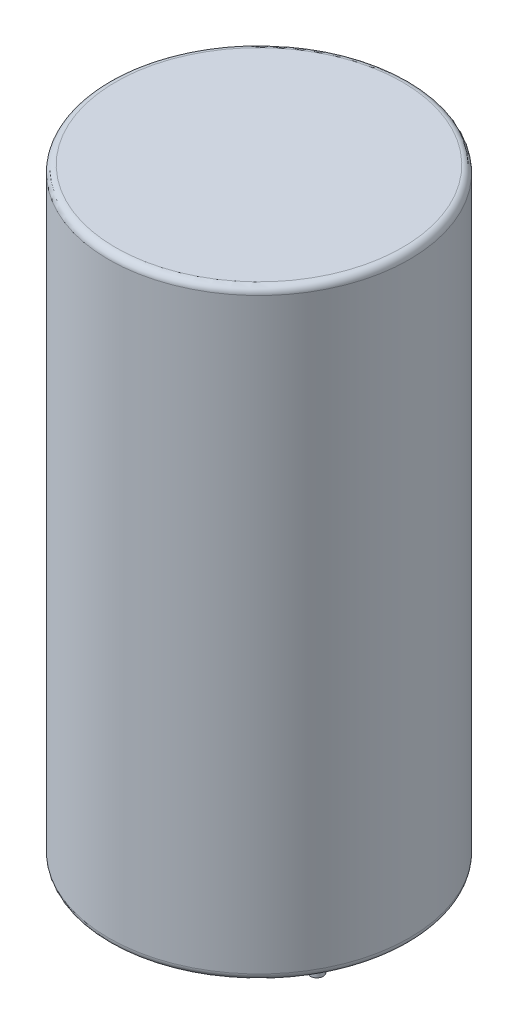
ISO-10303-21;
HEADER;
FILE_DESCRIPTION(('STEP AP214'),'2;1');
FILE_NAME('part.step','',(''),(''),'','','');
FILE_SCHEMA(('AUTOMOTIVE_DESIGN { 1 0 10303 214 1 1 1 1 }'));
ENDSEC;
DATA;
#1=APPLICATION_CONTEXT('core data for automotive mechanical design processes');
#2=APPLICATION_PROTOCOL_DEFINITION('international standard','automotive_design',2000,#1);
#3=PRODUCT_CONTEXT('',#1,'mechanical');
#4=PRODUCT('Part','Part','',(#3));
#5=PRODUCT_RELATED_PRODUCT_CATEGORY('part','',(#4));
#6=PRODUCT_DEFINITION_FORMATION('','',#4);
#7=PRODUCT_DEFINITION_CONTEXT('part definition',#1,'design');
#8=PRODUCT_DEFINITION('design','',#6,#7);
#9=PRODUCT_DEFINITION_SHAPE('','',#8);
#10=(LENGTH_UNIT() NAMED_UNIT(*) SI_UNIT(.MILLI.,.METRE.));
#11=(NAMED_UNIT(*) PLANE_ANGLE_UNIT() SI_UNIT($,.RADIAN.));
#12=(NAMED_UNIT(*) SI_UNIT($,.STERADIAN.) SOLID_ANGLE_UNIT());
#13=UNCERTAINTY_MEASURE_WITH_UNIT(LENGTH_MEASURE(1.E-05),#10,'distance_accuracy_value','');
#14=(GEOMETRIC_REPRESENTATION_CONTEXT(3) GLOBAL_UNCERTAINTY_ASSIGNED_CONTEXT((#13)) GLOBAL_UNIT_ASSIGNED_CONTEXT((#10,
#11,#12)) REPRESENTATION_CONTEXT('',''));
#15=CARTESIAN_POINT('',(0.,0.,0.));
#16=DIRECTION('',(0.,0.,1.));
#17=DIRECTION('',(1.,0.,0.));
#18=AXIS2_PLACEMENT_3D('',#15,#16,#17);
#19=CARTESIAN_POINT('',(0.,0.,0.));
#20=DIRECTION('',(0.,1.,0.));
#21=DIRECTION('',(0.,0.,1.));
#22=AXIS2_PLACEMENT_3D('',#19,#20,#21);
#23=PLANE('',#22);
#24=CARTESIAN_POINT('',(-2.5,0.,0.));
#25=DIRECTION('',(0.,1.,0.));
#26=DIRECTION('',(0.,0.,1.));
#27=AXIS2_PLACEMENT_3D('',#24,#25,#26);
#28=CIRCLE('',#27,0.275);
#29=CARTESIAN_POINT('',(-2.5,0.,0.275));
#30=VERTEX_POINT('',#29);
#31=EDGE_CURVE('E49',#30,#30,#28,.F.);
#32=ORIENTED_EDGE('',*,*,#31,.F.);
#33=EDGE_LOOP('',(#32));
#34=FACE_BOUND('',#33,.T.);
#35=CARTESIAN_POINT('',(0.,0.,0.));
#36=DIRECTION('',(0.,1.,0.));
#37=DIRECTION('',(0.,0.,1.));
#38=AXIS2_PLACEMENT_3D('',#35,#36,#37);
#39=CIRCLE('',#38,6.2);
#40=CARTESIAN_POINT('',(0.,0.,6.2));
#41=VERTEX_POINT('',#40);
#42=EDGE_CURVE('E57',#41,#41,#39,.F.);
#43=ORIENTED_EDGE('',*,*,#42,.T.);
#44=EDGE_LOOP('',(#43));
#45=FACE_BOUND('',#44,.T.);
#46=CARTESIAN_POINT('',(2.5,0.,0.));
#47=DIRECTION('',(0.,1.,0.));
#48=DIRECTION('',(0.,0.,1.));
#49=AXIS2_PLACEMENT_3D('',#46,#47,#48);
#50=CIRCLE('',#49,0.275);
#51=CARTESIAN_POINT('',(2.5,0.,0.275));
#52=VERTEX_POINT('',#51);
#53=EDGE_CURVE('E12',#52,#52,#50,.F.);
#54=ORIENTED_EDGE('',*,*,#53,.F.);
#55=EDGE_LOOP('',(#54));
#56=FACE_BOUND('',#55,.T.);
#57=ADVANCED_FACE('F42',(#34,#45,#56),#23,.F.);
#58=CARTESIAN_POINT('',(0.,26.,0.));
#59=DIRECTION('',(0.,-1.,0.));
#60=DIRECTION('',(0.,0.,-1.));
#61=AXIS2_PLACEMENT_3D('',#58,#59,#60);
#62=CYLINDRICAL_SURFACE('',#61,6.5);
#63=CARTESIAN_POINT('',(0.,0.300000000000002,0.));
#64=DIRECTION('',(0.,1.,0.));
#65=DIRECTION('',(0.,0.,1.));
#66=AXIS2_PLACEMENT_3D('',#63,#64,#65);
#67=CIRCLE('',#66,6.5);
#68=CARTESIAN_POINT('',(0.,0.300000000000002,-6.5));
#69=VERTEX_POINT('',#68);
#70=EDGE_CURVE('E62',#69,#69,#67,.T.);
#71=CARTESIAN_POINT('',(0.,25.7,0.));
#72=DIRECTION('',(0.,1.,0.));
#73=DIRECTION('',(0.,0.,1.));
#74=AXIS2_PLACEMENT_3D('',#71,#72,#73);
#75=CIRCLE('',#74,6.5);
#76=CARTESIAN_POINT('',(0.,25.7,-6.5));
#77=VERTEX_POINT('',#76);
#78=EDGE_CURVE('E65',#77,#77,#75,.F.);
#79=CARTESIAN_POINT('',(0.,0.300000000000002,-6.5));
#80=CARTESIAN_POINT('',(0.,0.564583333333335,-6.5));
#81=CARTESIAN_POINT('',(0.,0.829166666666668,-6.5));
#82=CARTESIAN_POINT('',(0.,1.35833333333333,-6.5));
#83=CARTESIAN_POINT('',(0.,1.62291666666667,-6.5));
#84=CARTESIAN_POINT('',(0.,2.15208333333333,-6.5));
#85=CARTESIAN_POINT('',(0.,2.41666666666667,-6.5));
#86=CARTESIAN_POINT('',(0.,2.94583333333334,-6.5));
#87=CARTESIAN_POINT('',(0.,3.21041666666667,-6.5));
#88=CARTESIAN_POINT('',(0.,3.73958333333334,-6.5));
#89=CARTESIAN_POINT('',(0.,4.00416666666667,-6.5));
#90=CARTESIAN_POINT('',(0.,4.53333333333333,-6.5));
#91=CARTESIAN_POINT('',(0.,4.79791666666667,-6.5));
#92=CARTESIAN_POINT('',(0.,5.32708333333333,-6.5));
#93=CARTESIAN_POINT('',(0.,5.59166666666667,-6.5));
#94=CARTESIAN_POINT('',(0.,6.12083333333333,-6.5));
#95=CARTESIAN_POINT('',(0.,6.38541666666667,-6.5));
#96=CARTESIAN_POINT('',(0.,6.91458333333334,-6.5));
#97=CARTESIAN_POINT('',(0.,7.17916666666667,-6.5));
#98=CARTESIAN_POINT('',(0.,7.70833333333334,-6.5));
#99=CARTESIAN_POINT('',(0.,7.97291666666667,-6.5));
#100=CARTESIAN_POINT('',(0.,8.50208333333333,-6.5));
#101=CARTESIAN_POINT('',(0.,8.76666666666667,-6.5));
#102=CARTESIAN_POINT('',(0.,9.29583333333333,-6.5));
#103=CARTESIAN_POINT('',(0.,9.56041666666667,-6.5));
#104=CARTESIAN_POINT('',(0.,10.0895833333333,-6.5));
#105=CARTESIAN_POINT('',(0.,10.3541666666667,-6.5));
#106=CARTESIAN_POINT('',(0.,10.8833333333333,-6.5));
#107=CARTESIAN_POINT('',(0.,11.1479166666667,-6.5));
#108=CARTESIAN_POINT('',(0.,11.6770833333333,-6.5));
#109=CARTESIAN_POINT('',(0.,11.9416666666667,-6.5));
#110=CARTESIAN_POINT('',(0.,12.4708333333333,-6.5));
#111=CARTESIAN_POINT('',(0.,12.7354166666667,-6.5));
#112=CARTESIAN_POINT('',(0.,13.2645833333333,-6.5));
#113=CARTESIAN_POINT('',(0.,13.5291666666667,-6.5));
#114=CARTESIAN_POINT('',(0.,14.0583333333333,-6.5));
#115=CARTESIAN_POINT('',(0.,14.3229166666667,-6.5));
#116=CARTESIAN_POINT('',(0.,14.8520833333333,-6.5));
#117=CARTESIAN_POINT('',(0.,15.1166666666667,-6.5));
#118=CARTESIAN_POINT('',(0.,15.6458333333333,-6.5));
#119=CARTESIAN_POINT('',(0.,15.9104166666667,-6.5));
#120=CARTESIAN_POINT('',(0.,16.4395833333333,-6.5));
#121=CARTESIAN_POINT('',(0.,16.7041666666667,-6.5));
#122=CARTESIAN_POINT('',(0.,17.2333333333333,-6.5));
#123=CARTESIAN_POINT('',(0.,17.4979166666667,-6.5));
#124=CARTESIAN_POINT('',(0.,18.0270833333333,-6.5));
#125=CARTESIAN_POINT('',(0.,18.2916666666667,-6.5));
#126=CARTESIAN_POINT('',(0.,18.8208333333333,-6.5));
#127=CARTESIAN_POINT('',(0.,19.0854166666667,-6.5));
#128=CARTESIAN_POINT('',(0.,19.6145833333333,-6.5));
#129=CARTESIAN_POINT('',(0.,19.8791666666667,-6.5));
#130=CARTESIAN_POINT('',(0.,20.4083333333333,-6.5));
#131=CARTESIAN_POINT('',(0.,20.6729166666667,-6.5));
#132=CARTESIAN_POINT('',(0.,21.2020833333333,-6.5));
#133=CARTESIAN_POINT('',(0.,21.4666666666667,-6.5));
#134=CARTESIAN_POINT('',(0.,21.9958333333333,-6.5));
#135=CARTESIAN_POINT('',(0.,22.2604166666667,-6.5));
#136=CARTESIAN_POINT('',(0.,22.7895833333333,-6.5));
#137=CARTESIAN_POINT('',(0.,23.0541666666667,-6.5));
#138=CARTESIAN_POINT('',(0.,23.5833333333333,-6.5));
#139=CARTESIAN_POINT('',(0.,23.8479166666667,-6.5));
#140=CARTESIAN_POINT('',(0.,24.3770833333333,-6.5));
#141=CARTESIAN_POINT('',(0.,24.6416666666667,-6.5));
#142=CARTESIAN_POINT('',(0.,25.1708333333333,-6.5));
#143=CARTESIAN_POINT('',(0.,25.4354166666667,-6.5));
#144=CARTESIAN_POINT('',(0.,25.7,-6.5));
#145=B_SPLINE_CURVE_WITH_KNOTS('',3,(#79,#80,#81,#82,#83,#84,#85,#86,#87,#88,#89,#90,#91,#92,
#93,#94,#95,#96,#97,#98,#99,#100,#101,#102,#103,#104,#105,#106,#107,#108,#109,#110,#111,#112,
#113,#114,#115,#116,#117,#118,#119,#120,#121,#122,#123,#124,#125,#126,#127,#128,#129,#130,#131,
#132,#133,#134,#135,#136,#137,#138,#139,#140,#141,#142,#143,#144),.UNSPECIFIED.,.F.,.F.,(4,2,2,
2,2,2,2,2,2,2,2,2,2,2,2,2,2,2,2,2,2,2,2,2,2,2,2,2,2,2,2,2,4),(0.,0.793749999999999,1.5875,
2.38125,3.175,3.96875,4.7625,5.55625,6.35,7.14375,7.9375,8.73125,9.525,10.31875,11.1125,
11.90625,12.7,13.49375,14.2875,15.08125,15.875,16.66875,17.4625,18.25625,19.05,19.84375,20.6375,
21.43125,22.225,23.01875,23.8125,24.60625,25.4),.UNSPECIFIED.);
#146=EDGE_CURVE('BSEAM90',#69,#77,#145,.T.);
#147=ORIENTED_EDGE('',*,*,#70,.T.);
#148=ORIENTED_EDGE('',*,*,#78,.T.);
#149=ORIENTED_EDGE('',*,*,#146,.T.);
#150=ORIENTED_EDGE('',*,*,#146,.F.);
#151=EDGE_LOOP('',(#147,#149,#148,#150));
#152=FACE_BOUND('',#151,.T.);
#153=ADVANCED_FACE('F90',(#152),#62,.T.);
#154=CARTESIAN_POINT('',(0.,26.,0.));
#155=DIRECTION('',(0.,1.,0.));
#156=DIRECTION('',(0.,0.,1.));
#157=AXIS2_PLACEMENT_3D('',#154,#155,#156);
#158=PLANE('',#157);
#159=CARTESIAN_POINT('',(0.,26.,0.));
#160=DIRECTION('',(0.,1.,0.));
#161=DIRECTION('',(0.,0.,1.));
#162=AXIS2_PLACEMENT_3D('',#159,#160,#161);
#163=CIRCLE('',#162,6.2);
#164=CARTESIAN_POINT('',(0.,26.,6.2));
#165=VERTEX_POINT('',#164);
#166=EDGE_CURVE('E53',#165,#165,#163,.T.);
#167=ORIENTED_EDGE('',*,*,#166,.T.);
#168=EDGE_LOOP('',(#167));
#169=FACE_BOUND('',#168,.T.);
#170=ADVANCED_FACE('F96',(#169),#158,.T.);
#171=CARTESIAN_POINT('',(0.,0.300000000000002,0.));
#172=DIRECTION('',(0.,1.,0.));
#173=DIRECTION('',(0.,0.,1.));
#174=AXIS2_PLACEMENT_3D('',#171,#172,#173);
#175=TOROIDAL_SURFACE('',#174,6.2,0.3);
#176=ORIENTED_EDGE('',*,*,#42,.F.);
#177=EDGE_LOOP('',(#176));
#178=FACE_BOUND('',#177,.T.);
#179=ORIENTED_EDGE('',*,*,#70,.F.);
#180=EDGE_LOOP('',(#179));
#181=FACE_BOUND('',#180,.T.);
#182=ADVANCED_FACE('F102',(#178,#181),#175,.T.);
#183=CARTESIAN_POINT('',(0.,25.7,0.));
#184=DIRECTION('',(0.,1.,0.));
#185=DIRECTION('',(0.,0.,1.));
#186=AXIS2_PLACEMENT_3D('',#183,#184,#185);
#187=TOROIDAL_SURFACE('',#186,6.2,0.3);
#188=ORIENTED_EDGE('',*,*,#78,.F.);
#189=EDGE_LOOP('',(#188));
#190=FACE_BOUND('',#189,.T.);
#191=ORIENTED_EDGE('',*,*,#166,.F.);
#192=EDGE_LOOP('',(#191));
#193=FACE_BOUND('',#192,.T.);
#194=ADVANCED_FACE('F44',(#190,#193),#187,.T.);
#195=CARTESIAN_POINT('',(-2.5,-3.,0.));
#196=DIRECTION('',(0.,1.,0.));
#197=DIRECTION('',(0.,0.,1.));
#198=AXIS2_PLACEMENT_3D('',#195,#196,#197);
#199=CYLINDRICAL_SURFACE('',#198,0.275);
#200=CARTESIAN_POINT('',(-2.5,-3.,0.));
#201=DIRECTION('',(0.,-1.,0.));
#202=DIRECTION('',(0.,0.,-1.));
#203=AXIS2_PLACEMENT_3D('',#200,#201,#202);
#204=CIRCLE('',#203,0.275);
#205=CARTESIAN_POINT('',(-2.5,-3.,-0.275));
#206=VERTEX_POINT('',#205);
#207=EDGE_CURVE('E68',#206,#206,#204,.T.);
#208=ORIENTED_EDGE('',*,*,#207,.F.);
#209=EDGE_LOOP('',(#208));
#210=FACE_BOUND('',#209,.T.);
#211=ORIENTED_EDGE('',*,*,#31,.T.);
#212=EDGE_LOOP('',(#211));
#213=FACE_BOUND('',#212,.T.);
#214=ADVANCED_FACE('F86',(#210,#213),#199,.T.);
#215=CARTESIAN_POINT('',(-2.5,-3.,0.));
#216=DIRECTION('',(0.,-1.,0.));
#217=DIRECTION('',(0.,0.,-1.));
#218=AXIS2_PLACEMENT_3D('',#215,#216,#217);
#219=PLANE('',#218);
#220=ORIENTED_EDGE('',*,*,#207,.T.);
#221=EDGE_LOOP('',(#220));
#222=FACE_BOUND('',#221,.T.);
#223=ADVANCED_FACE('F79',(#222),#219,.T.);
#224=CARTESIAN_POINT('',(2.5,-3.,0.));
#225=DIRECTION('',(0.,1.,0.));
#226=DIRECTION('',(0.,0.,1.));
#227=AXIS2_PLACEMENT_3D('',#224,#225,#226);
#228=CYLINDRICAL_SURFACE('',#227,0.275);
#229=CARTESIAN_POINT('',(2.5,-3.,0.));
#230=DIRECTION('',(0.,-1.,0.));
#231=DIRECTION('',(0.,0.,1.));
#232=AXIS2_PLACEMENT_3D('',#229,#230,#231);
#233=CIRCLE('',#232,0.275);
#234=CARTESIAN_POINT('',(2.5,-3.,0.275));
#235=VERTEX_POINT('',#234);
#236=EDGE_CURVE('E71',#235,#235,#233,.T.);
#237=ORIENTED_EDGE('',*,*,#236,.F.);
#238=EDGE_LOOP('',(#237));
#239=FACE_BOUND('',#238,.T.);
#240=ORIENTED_EDGE('',*,*,#53,.T.);
#241=EDGE_LOOP('',(#240));
#242=FACE_BOUND('',#241,.T.);
#243=ADVANCED_FACE('F77',(#239,#242),#228,.T.);
#244=CARTESIAN_POINT('',(2.5,-3.,0.));
#245=DIRECTION('',(0.,1.,0.));
#246=DIRECTION('',(0.,0.,1.));
#247=AXIS2_PLACEMENT_3D('',#244,#245,#246);
#248=PLANE('',#247);
#249=ORIENTED_EDGE('',*,*,#236,.T.);
#250=EDGE_LOOP('',(#249));
#251=FACE_BOUND('',#250,.T.);
#252=ADVANCED_FACE('F75',(#251),#248,.F.);
#253=CLOSED_SHELL('',(#57,#153,#170,#182,#194,#214,#223,#243,#252));
#254=MANIFOLD_SOLID_BREP('B2',#253);
#255=ADVANCED_BREP_SHAPE_REPRESENTATION('',(#18,#254),#14);
#256=SHAPE_DEFINITION_REPRESENTATION(#9,#255);
ENDSEC;
END-ISO-10303-21;
